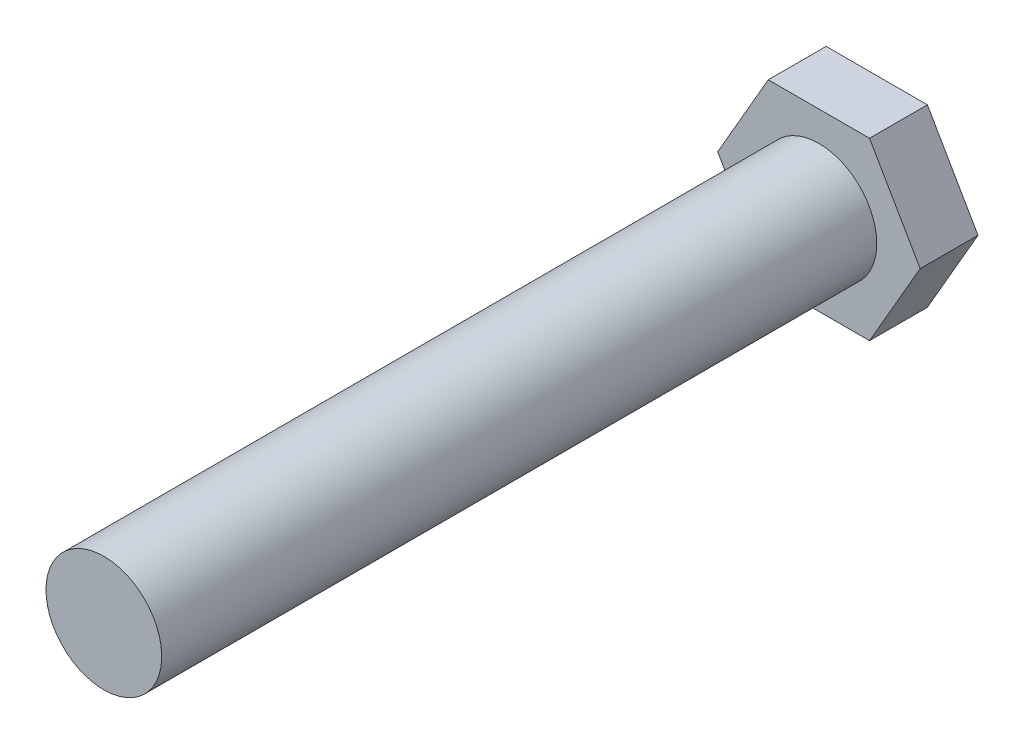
from build123d import *

# Parameters (mm, degrees)
BOSS_EXTRUDE1_DEPTH = 12.7
SKETCH2_W           = 12.7
SKETCH2_H           = 156.972


with BuildPart() as part:
    # Sketch1 → Boss-Extrude1 (new body)
    with BuildSketch(Plane.XY.offset(12.7)):
        Polygon((11.1125, -19.247414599), (22.225, 0), (11.1125, 19.247414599), (-11.1125, 19.247414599), (-22.225, 0), (-11.1125, -19.247414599), align=None)
    extrude(amount=-BOSS_EXTRUDE1_DEPTH)

    # Sketch2 → Revolve1 (revolve)
    with BuildSketch(Plane.XZ, mode=Mode.PRIVATE) as revolve1_sk:
        with Locations((6.35, 91.186)):
            Rectangle(SKETCH2_W, SKETCH2_H)
    revolve(revolve1_sk.sketch.rotate(Axis((0, 0, 169.672), (0, 0, -1)), 180), axis=Axis((0, 0, 169.672), (0, 0, -1)))


solid = part.part
